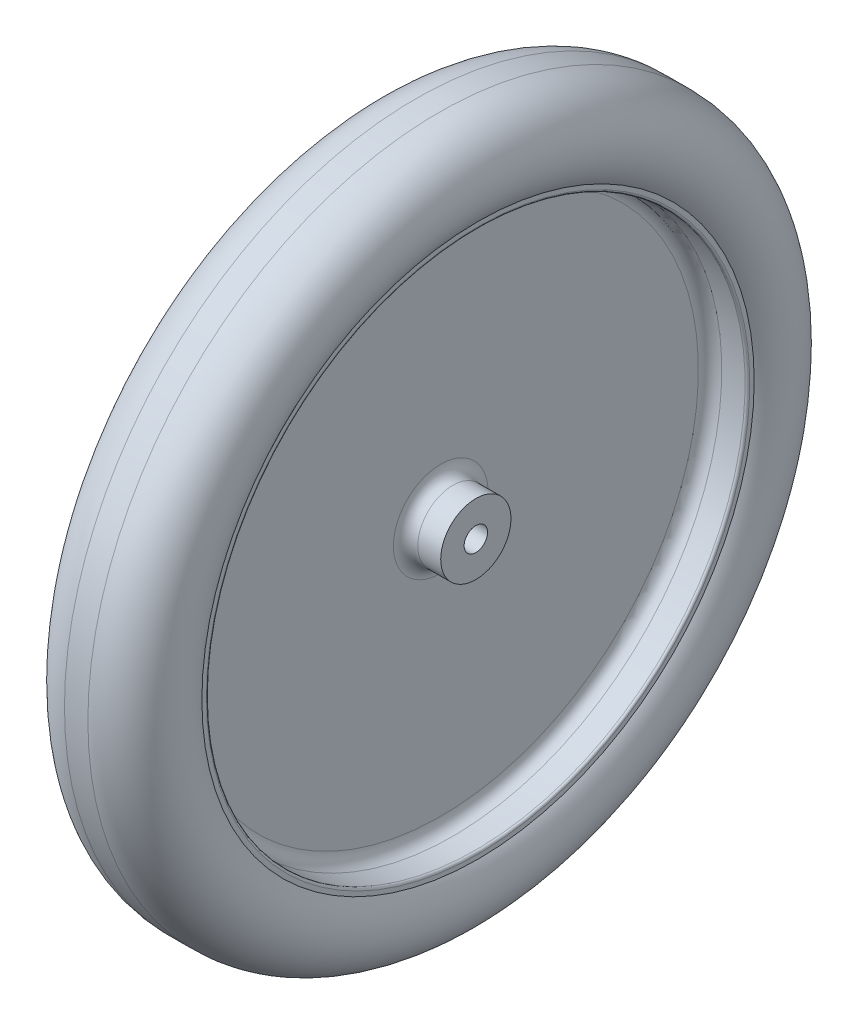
from build123d import *


with BuildPart() as part:
    # Esquisse2 → R_volution1 (revolve)
    with BuildSketch(Plane.XY, mode=Mode.PRIVATE) as r_volution1_sk:
        with BuildLine():
            Line((-9.954665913, 30), (-28.643760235, 30))
            Line((-28.643760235, 30), (-28.643760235, 10))
            Line((-28.643760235, 10), (51.356239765, 10))
            Line((51.356239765, 10), (51.356239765, 30))
            Line((51.356239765, 30), (31.756871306, 30))
            ThreePointArc((31.756871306, 30), (24.402514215, 33.04627445), (21.356239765, 40.400631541))
            Line((21.356239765, 40.400631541), (21.356239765, 220.079406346))
            ThreePointArc((21.356239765, 220.079406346), (24.285171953, 227.150474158), (31.356239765, 230.079406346))
            Line((31.356239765, 230.079406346), (51.239670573, 230.079406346))
            ThreePointArc((51.239670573, 230.079406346), (52.653884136, 230.665192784), (53.239670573, 232.079406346))
            Line((53.239670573, 232.079406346), (53.239670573, 235.868354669))
            ThreePointArc((53.239670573, 235.868354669), (56.869537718, 278.429673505), (20, 300))
            Line((20, 300), (0, 300))
            ThreePointArc((0, 300), (-34.646750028, 277.452420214), (-30.842517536, 236.290320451))
            Line((-30.842517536, 236.290320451), (-30.842517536, 232.079406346))
            ThreePointArc((-30.842517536, 232.079406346), (-30.256731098, 230.665192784), (-28.842517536, 230.079406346))
            Line((-28.842517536, 230.079406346), (-8.643760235, 230.079406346))
            ThreePointArc((-8.643760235, 230.079406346), (-1.572692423, 227.150474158), (1.356239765, 220.079406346))
            Line((1.356239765, 220.079406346), (1.356239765, 41.310905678))
            ThreePointArc((1.356239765, 41.310905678), (-1.956647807, 33.312887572), (-9.954665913, 30))
        make_face()
    revolve(r_volution1_sk.sketch.rotate(Axis((-36.268459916, 0, 0), (1, 0, 0)), 90), axis=Axis((-36.268459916, 0, 0), (1, 0, 0)))


solid = part.part
